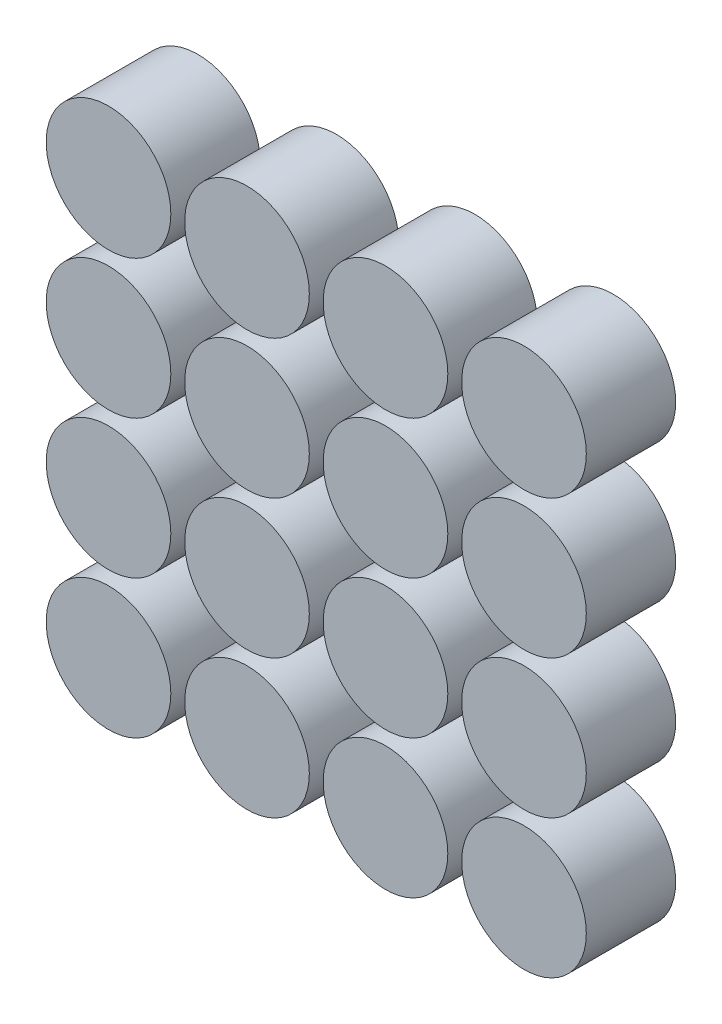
from build123d import *

# Parameters (mm, degrees)
SKETCH_1_R                      = 4.95
SIXTEEN_NOMINAL_BODIES_DEPTH    = 7.1
SIXTEEN_NOMINAL_BODIES_2_DEPTH  = 7.1
SIXTEEN_NOMINAL_BODIES_3_DEPTH  = 7.1
SIXTEEN_NOMINAL_BODIES_4_DEPTH  = 7.1
SIXTEEN_NOMINAL_BODIES_5_DEPTH  = 7.1
SIXTEEN_NOMINAL_BODIES_6_DEPTH  = 7.1
SIXTEEN_NOMINAL_BODIES_7_DEPTH  = 7.1
SIXTEEN_NOMINAL_BODIES_8_DEPTH  = 7.1
SIXTEEN_NOMINAL_BODIES_9_DEPTH  = 7.1
SIXTEEN_NOMINAL_BODIES_10_DEPTH = 7.1
SIXTEEN_NOMINAL_BODIES_11_DEPTH = 7.1
SIXTEEN_NOMINAL_BODIES_12_DEPTH = 7.1
SIXTEEN_NOMINAL_BODIES_13_DEPTH = 7.1
SIXTEEN_NOMINAL_BODIES_14_DEPTH = 7.1
SIXTEEN_NOMINAL_BODIES_15_DEPTH = 7.1
SIXTEEN_NOMINAL_BODIES_16_DEPTH = 7.1


with BuildPart() as part:
    # Sketch 1 → Sixteen_nominal_bodies (new body)
    with BuildSketch(Plane.XY):
        with Locations((-16.5, -16.5)):
            Circle(SKETCH_1_R)
    extrude(amount=SIXTEEN_NOMINAL_BODIES_DEPTH)


with BuildPart() as body_2:
    # Sketch 1 → Sixteen_nominal_bodies 2 (new body)
    with BuildSketch(Plane.XY):
        with Locations((-5.5, -16.5)):
            Circle(SKETCH_1_R)
    extrude(amount=SIXTEEN_NOMINAL_BODIES_2_DEPTH)


with BuildPart() as body_3:
    # Sketch 1 → Sixteen_nominal_bodies 3 (new body)
    with BuildSketch(Plane.XY):
        with Locations((5.5, -16.5)):
            Circle(SKETCH_1_R)
    extrude(amount=SIXTEEN_NOMINAL_BODIES_3_DEPTH)


with BuildPart() as body_4:
    # Sketch 1 → Sixteen_nominal_bodies 4 (new body)
    with BuildSketch(Plane.XY):
        with Locations((16.5, -16.5)):
            Circle(SKETCH_1_R)
    extrude(amount=SIXTEEN_NOMINAL_BODIES_4_DEPTH)


with BuildPart() as body_5:
    # Sketch 1 → Sixteen_nominal_bodies 5 (new body)
    with BuildSketch(Plane.XY):
        with Locations((-16.5, -5.5)):
            Circle(SKETCH_1_R)
    extrude(amount=SIXTEEN_NOMINAL_BODIES_5_DEPTH)


with BuildPart() as body_6:
    # Sketch 1 → Sixteen_nominal_bodies 6 (new body)
    with BuildSketch(Plane.XY):
        with Locations((-5.5, -5.5)):
            Circle(SKETCH_1_R)
    extrude(amount=SIXTEEN_NOMINAL_BODIES_6_DEPTH)


with BuildPart() as body_7:
    # Sketch 1 → Sixteen_nominal_bodies 7 (new body)
    with BuildSketch(Plane.XY):
        with Locations((5.5, -5.5)):
            Circle(SKETCH_1_R)
    extrude(amount=SIXTEEN_NOMINAL_BODIES_7_DEPTH)


with BuildPart() as body_8:
    # Sketch 1 → Sixteen_nominal_bodies 8 (new body)
    with BuildSketch(Plane.XY):
        with Locations((16.5, -5.5)):
            Circle(SKETCH_1_R)
    extrude(amount=SIXTEEN_NOMINAL_BODIES_8_DEPTH)


with BuildPart() as body_9:
    # Sketch 1 → Sixteen_nominal_bodies 9 (new body)
    with BuildSketch(Plane.XY):
        with Locations((-16.5, 5.5)):
            Circle(SKETCH_1_R)
    extrude(amount=SIXTEEN_NOMINAL_BODIES_9_DEPTH)


with BuildPart() as body_10:
    # Sketch 1 → Sixteen_nominal_bodies 10 (new body)
    with BuildSketch(Plane.XY):
        with Locations((-5.5, 5.5)):
            Circle(SKETCH_1_R)
    extrude(amount=SIXTEEN_NOMINAL_BODIES_10_DEPTH)


with BuildPart() as body_11:
    # Sketch 1 → Sixteen_nominal_bodies 11 (new body)
    with BuildSketch(Plane.XY):
        with Locations((5.5, 5.5)):
            Circle(SKETCH_1_R)
    extrude(amount=SIXTEEN_NOMINAL_BODIES_11_DEPTH)


with BuildPart() as body_12:
    # Sketch 1 → Sixteen_nominal_bodies 12 (new body)
    with BuildSketch(Plane.XY):
        with Locations((16.5, 5.5)):
            Circle(SKETCH_1_R)
    extrude(amount=SIXTEEN_NOMINAL_BODIES_12_DEPTH)


with BuildPart() as body_13:
    # Sketch 1 → Sixteen_nominal_bodies 13 (new body)
    with BuildSketch(Plane.XY):
        with Locations((-16.5, 16.5)):
            Circle(SKETCH_1_R)
    extrude(amount=SIXTEEN_NOMINAL_BODIES_13_DEPTH)


with BuildPart() as body_14:
    # Sketch 1 → Sixteen_nominal_bodies 14 (new body)
    with BuildSketch(Plane.XY):
        with Locations((-5.5, 16.5)):
            Circle(SKETCH_1_R)
    extrude(amount=SIXTEEN_NOMINAL_BODIES_14_DEPTH)


with BuildPart() as body_15:
    # Sketch 1 → Sixteen_nominal_bodies 15 (new body)
    with BuildSketch(Plane.XY):
        with Locations((5.5, 16.5)):
            Circle(SKETCH_1_R)
    extrude(amount=SIXTEEN_NOMINAL_BODIES_15_DEPTH)


with BuildPart() as body_16:
    # Sketch 1 → Sixteen_nominal_bodies 16 (new body)
    with BuildSketch(Plane.XY):
        with Locations((16.5, 16.5)):
            Circle(SKETCH_1_R)
    extrude(amount=SIXTEEN_NOMINAL_BODIES_16_DEPTH)


solid = Compound([part.part, body_2.part, body_3.part, body_4.part, body_5.part, body_6.part, body_7.part, body_8.part, body_9.part, body_10.part, body_11.part, body_12.part, body_13.part, body_14.part, body_15.part, body_16.part])
